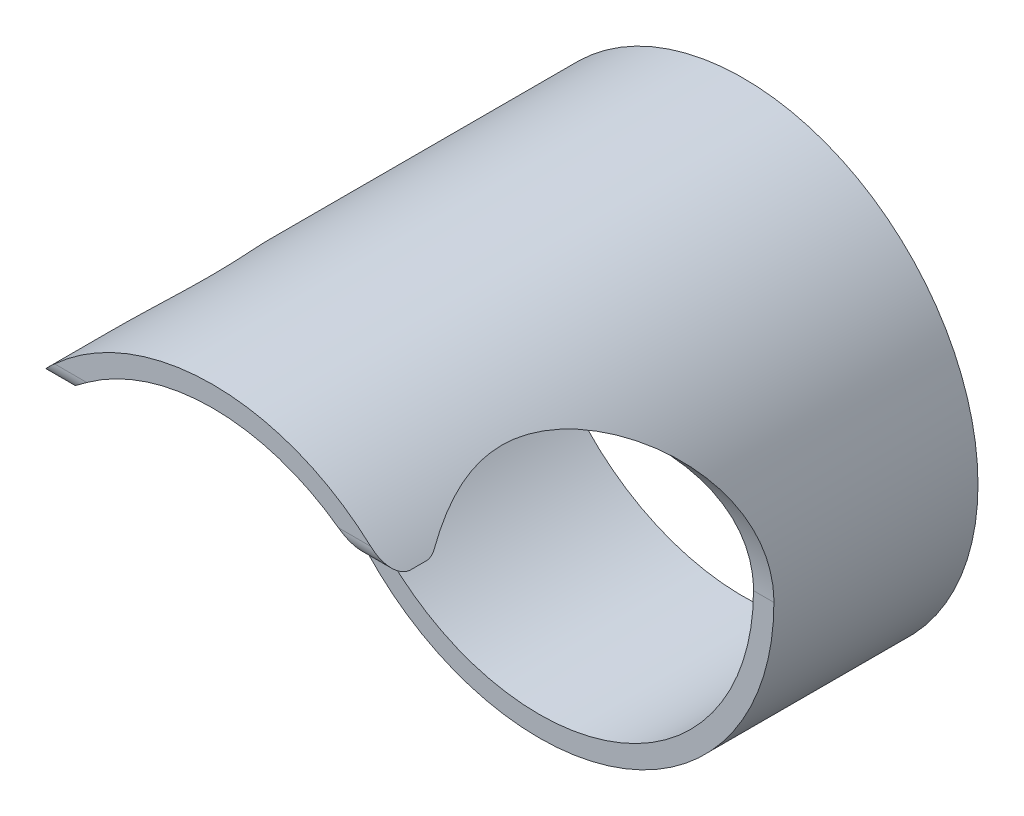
ISO-10303-21;
HEADER;
FILE_DESCRIPTION(('STEP AP214'),'2;1');
FILE_NAME('part.step','',(''),(''),'','','');
FILE_SCHEMA(('AUTOMOTIVE_DESIGN { 1 0 10303 214 1 1 1 1 }'));
ENDSEC;
DATA;
#1=APPLICATION_CONTEXT('core data for automotive mechanical design processes');
#2=APPLICATION_PROTOCOL_DEFINITION('international standard','automotive_design',2000,#1);
#3=PRODUCT_CONTEXT('',#1,'mechanical');
#4=PRODUCT('Part','Part','',(#3));
#5=PRODUCT_RELATED_PRODUCT_CATEGORY('part','',(#4));
#6=PRODUCT_DEFINITION_FORMATION('','',#4);
#7=PRODUCT_DEFINITION_CONTEXT('part definition',#1,'design');
#8=PRODUCT_DEFINITION('design','',#6,#7);
#9=PRODUCT_DEFINITION_SHAPE('','',#8);
#10=(LENGTH_UNIT() NAMED_UNIT(*) SI_UNIT(.MILLI.,.METRE.));
#11=(NAMED_UNIT(*) PLANE_ANGLE_UNIT() SI_UNIT($,.RADIAN.));
#12=(NAMED_UNIT(*) SI_UNIT($,.STERADIAN.) SOLID_ANGLE_UNIT());
#13=UNCERTAINTY_MEASURE_WITH_UNIT(LENGTH_MEASURE(1.E-05),#10,'distance_accuracy_value','');
#14=(GEOMETRIC_REPRESENTATION_CONTEXT(3) GLOBAL_UNCERTAINTY_ASSIGNED_CONTEXT((#13)) GLOBAL_UNIT_ASSIGNED_CONTEXT((#10,
#11,#12)) REPRESENTATION_CONTEXT('',''));
#15=CARTESIAN_POINT('',(0.,0.,0.));
#16=DIRECTION('',(0.,0.,1.));
#17=DIRECTION('',(1.,0.,0.));
#18=AXIS2_PLACEMENT_3D('',#15,#16,#17);
#19=CARTESIAN_POINT('',(0.,0.,130.));
#20=DIRECTION('',(0.,0.,-1.));
#21=DIRECTION('',(-1.,0.,0.));
#22=AXIS2_PLACEMENT_3D('',#19,#20,#21);
#23=CYLINDRICAL_SURFACE('',#22,57.5);
#24=CARTESIAN_POINT('',(0.,0.,0.));
#25=DIRECTION('',(0.,0.,1.));
#26=DIRECTION('',(1.,0.,0.));
#27=AXIS2_PLACEMENT_3D('',#24,#25,#26);
#28=CIRCLE('',#27,57.5);
#29=CARTESIAN_POINT('',(57.5,0.,0.));
#30=VERTEX_POINT('',#29);
#31=EDGE_CURVE('E271',#30,#30,#28,.T.);
#32=ORIENTED_EDGE('',*,*,#31,.T.);
#33=EDGE_LOOP('',(#32));
#34=FACE_BOUND('',#33,.T.);
#35=DIRECTION('',(0.,0.,-1.));
#36=VECTOR('',#35,1.);
#37=CARTESIAN_POINT('',(43.5889894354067,37.5,130.));
#38=LINE('',#37,#36);
#39=CARTESIAN_POINT('',(43.5889894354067,37.5,125.));
#40=VERTEX_POINT('',#39);
#41=CARTESIAN_POINT('',(43.5889894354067,37.5,121.339134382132));
#42=VERTEX_POINT('',#41);
#43=EDGE_CURVE('E129',#40,#42,#38,.T.);
#44=ORIENTED_EDGE('',*,*,#43,.T.);
#45=CARTESIAN_POINT('',(43.5889894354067,37.5,121.339134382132));
#46=CARTESIAN_POINT('',(43.5890098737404,37.4999712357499,121.22110299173));
#47=CARTESIAN_POINT('',(43.5853948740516,37.5041780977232,121.10308494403));
#48=CARTESIAN_POINT('',(43.5710463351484,37.5208494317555,120.868130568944));
#49=CARTESIAN_POINT('',(43.5603166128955,37.5333094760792,120.75119369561));
#50=CARTESIAN_POINT('',(43.532297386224,37.5658022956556,120.522645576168));
#51=CARTESIAN_POINT('',(43.5152043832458,37.5856081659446,120.410977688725));
#52=CARTESIAN_POINT('',(43.474697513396,37.6324546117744,120.190345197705));
#53=CARTESIAN_POINT('',(43.4512835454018,37.6594953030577,120.081380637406));
#54=CARTESIAN_POINT('',(43.396895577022,37.7221588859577,119.860564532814));
#55=CARTESIAN_POINT('',(43.3655583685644,37.7581925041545,119.748919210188));
#56=CARTESIAN_POINT('',(43.2965754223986,37.8372740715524,119.530121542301));
#57=CARTESIAN_POINT('',(43.2589275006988,37.8803244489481,119.422970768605));
#58=CARTESIAN_POINT('',(43.17652193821,37.9742277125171,119.21044985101));
#59=CARTESIAN_POINT('',(43.1315774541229,38.0252839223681,119.105242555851));
#60=CARTESIAN_POINT('',(43.0360600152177,38.1333548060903,118.900732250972));
#61=CARTESIAN_POINT('',(42.9854920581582,38.1903641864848,118.801424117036));
#62=CARTESIAN_POINT('',(42.9323595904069,38.25,118.705220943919));
#63=B_SPLINE_CURVE_WITH_KNOTS('',3,(#45,#46,#47,#48,#49,#50,#51,#52,#53,#54,#55,#56,#57,#58,#59,
#60,#61,#62),.UNSPECIFIED.,.F.,.F.,(4,2,2,2,2,2,2,2,4),(0.,0.353943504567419,0.707697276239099,
1.05132800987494,1.39496424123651,1.75877988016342,2.12272168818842,2.49814635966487,
2.87324000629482),.UNSPECIFIED.);
#64=CARTESIAN_POINT('',(42.9323595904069,38.25,118.705220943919));
#65=VERTEX_POINT('',#64);
#66=EDGE_CURVE('E114',#42,#65,#63,.T.);
#67=ORIENTED_EDGE('',*,*,#66,.T.);
#68=CARTESIAN_POINT('',(43.5889894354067,37.5,119.874685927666));
#69=CARTESIAN_POINT('',(43.3441791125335,37.7845707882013,119.445662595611));
#70=CARTESIAN_POINT('',(43.1005511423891,38.0621109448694,119.011288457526));
#71=CARTESIAN_POINT('',(42.6168254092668,38.6029486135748,118.131777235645));
#72=CARTESIAN_POINT('',(42.3767279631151,38.8662448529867,117.686639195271));
#73=CARTESIAN_POINT('',(41.9008952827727,39.378769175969,116.784899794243));
#74=CARTESIAN_POINT('',(41.6651675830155,39.6279742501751,116.328281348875));
#75=CARTESIAN_POINT('',(41.199814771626,40.1115686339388,115.404263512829));
#76=CARTESIAN_POINT('',(40.9701895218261,40.3459582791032,114.936864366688));
#77=CARTESIAN_POINT('',(40.2859477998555,41.0330812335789,113.504564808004));
#78=CARTESIAN_POINT('',(39.8429367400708,41.4623250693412,112.522608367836));
#79=CARTESIAN_POINT('',(39.0015243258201,42.2547637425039,110.514477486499));
#80=CARTESIAN_POINT('',(38.6030953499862,42.6179995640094,109.488330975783));
#81=CARTESIAN_POINT('',(37.9512991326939,43.1983009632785,107.634106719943));
#82=CARTESIAN_POINT('',(37.6856584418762,43.4297629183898,106.814855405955));
#83=CARTESIAN_POINT('',(37.1979345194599,43.8482268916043,105.152222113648));
#84=CARTESIAN_POINT('',(36.975849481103,44.035230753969,104.30884113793));
#85=CARTESIAN_POINT('',(36.5843600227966,44.3610111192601,102.605781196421));
#86=CARTESIAN_POINT('',(36.4146679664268,44.5000514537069,101.746219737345));
#87=CARTESIAN_POINT('',(36.1334755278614,44.7286820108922,100.011038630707));
#88=CARTESIAN_POINT('',(36.0219723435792,44.8182746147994,99.1354197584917));
#89=CARTESIAN_POINT('',(35.8617602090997,44.9465793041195,97.366200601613));
#90=CARTESIAN_POINT('',(35.8136589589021,44.9847990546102,96.4725084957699));
#91=CARTESIAN_POINT('',(35.7847769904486,45.0077782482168,94.6833593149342));
#92=CARTESIAN_POINT('',(35.8039944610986,44.9925391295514,93.7879022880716));
#93=CARTESIAN_POINT('',(35.908805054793,44.9089312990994,92.0019175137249));
#94=CARTESIAN_POINT('',(35.994510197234,44.8404729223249,91.1114006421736));
#95=CARTESIAN_POINT('',(36.2280424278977,44.6520010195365,89.3441188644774));
#96=CARTESIAN_POINT('',(36.3758784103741,44.5319801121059,88.4673559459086));
#97=CARTESIAN_POINT('',(36.7546731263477,44.220054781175,86.5962594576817));
#98=CARTESIAN_POINT('',(36.9950757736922,44.0197879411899,85.6052420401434));
#99=CARTESIAN_POINT('',(37.5377005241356,43.5579789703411,83.6550679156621));
#100=CARTESIAN_POINT('',(37.8399356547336,43.2964239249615,82.6959179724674));
#101=CARTESIAN_POINT('',(38.494273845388,42.7157174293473,80.8104687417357));
#102=CARTESIAN_POINT('',(38.8464826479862,42.3964434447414,79.8842444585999));
#103=CARTESIAN_POINT('',(39.588679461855,41.7042423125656,78.067750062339));
#104=CARTESIAN_POINT('',(39.9786703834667,41.3313110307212,77.1774827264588));
#105=CARTESIAN_POINT('',(40.6720818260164,40.6472329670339,75.679660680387));
#106=CARTESIAN_POINT('',(40.9688242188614,40.3484060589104,75.063305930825));
#107=CARTESIAN_POINT('',(41.5732698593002,39.7253268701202,73.8490159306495));
#108=CARTESIAN_POINT('',(41.8809740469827,39.4010724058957,73.251082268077));
#109=CARTESIAN_POINT('',(42.5044506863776,38.7276680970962,72.0734221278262));
#110=CARTESIAN_POINT('',(42.8202257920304,38.3785099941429,71.4937017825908));
#111=CARTESIAN_POINT('',(43.4570574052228,37.6558927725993,70.3526940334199));
#112=CARTESIAN_POINT('',(43.77811378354,37.2824342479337,69.7914061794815));
#113=CARTESIAN_POINT('',(44.7462079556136,36.1253097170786,68.1340429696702));
#114=CARTESIAN_POINT('',(45.3976385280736,35.3054617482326,67.065457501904));
#115=CARTESIAN_POINT('',(46.6943678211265,33.5716924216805,65.004087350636));
#116=CARTESIAN_POINT('',(47.339667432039,32.6577849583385,64.0112915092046));
#117=CARTESIAN_POINT('',(48.6195646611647,30.7206511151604,62.0889873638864));
#118=CARTESIAN_POINT('',(49.2537982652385,29.6958410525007,61.1608287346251));
#119=CARTESIAN_POINT('',(50.4848705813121,27.5509748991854,59.3927742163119));
#120=CARTESIAN_POINT('',(51.0817037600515,26.4309047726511,58.5528913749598));
#121=CARTESIAN_POINT('',(51.9365386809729,24.6833134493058,57.367188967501));
#122=CARTESIAN_POINT('',(52.2145080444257,24.0901182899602,56.9846299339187));
#123=CARTESIAN_POINT('',(52.7553809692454,22.881387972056,56.2450789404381));
#124=CARTESIAN_POINT('',(53.0182867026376,22.2658560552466,55.888083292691));
#125=CARTESIAN_POINT('',(53.5270622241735,21.0133378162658,55.2011355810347));
#126=CARTESIAN_POINT('',(53.7729379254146,20.3763590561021,54.8711741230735));
#127=CARTESIAN_POINT('',(54.2458414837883,19.0817617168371,54.2396627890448));
#128=CARTESIAN_POINT('',(54.4728713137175,18.4241453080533,53.9381099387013));
#129=CARTESIAN_POINT('',(54.9938503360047,16.8195342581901,53.2490349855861));
#130=CARTESIAN_POINT('',(55.2777773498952,15.8629699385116,52.8760032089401));
#131=CARTESIAN_POINT('',(55.7998834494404,13.9154328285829,52.1931618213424));
#132=CARTESIAN_POINT('',(56.0380656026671,12.9244623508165,51.8833479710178));
#133=CARTESIAN_POINT('',(56.463805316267,10.9151903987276,51.3314519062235));
#134=CARTESIAN_POINT('',(56.6514549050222,9.89694237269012,51.0892465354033));
#135=CARTESIAN_POINT('',(56.9727990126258,7.83802090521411,50.6754369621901));
#136=CARTESIAN_POINT('',(57.1065153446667,6.79735670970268,50.5038042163));
#137=CARTESIAN_POINT('',(57.2595808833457,5.27435902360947,50.3075960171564));
#138=CARTESIAN_POINT('',(57.3014905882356,4.79779807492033,50.2539204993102));
#139=CARTESIAN_POINT('',(57.373471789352,3.84239890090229,50.161778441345));
#140=CARTESIAN_POINT('',(57.4035461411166,3.36356125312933,50.1233082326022));
#141=CARTESIAN_POINT('',(57.4517141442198,2.4043833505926,50.061710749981));
#142=CARTESIAN_POINT('',(57.4698097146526,1.92404334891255,50.0385810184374));
#143=CARTESIAN_POINT('',(57.4939586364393,0.962471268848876,50.0077195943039));
#144=CARTESIAN_POINT('',(57.5000095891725,0.481239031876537,49.9999909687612));
#145=CARTESIAN_POINT('',(57.5,0.,50.));
#146=B_SPLINE_CURVE_WITH_KNOTS('',3,(#68,#69,#70,#71,#72,#73,#74,#75,#76,#77,#78,#79,#80,#81,
#82,#83,#84,#85,#86,#87,#88,#89,#90,#91,#92,#93,#94,#95,#96,#97,#98,#99,#100,#101,#102,#103,
#104,#105,#106,#107,#108,#109,#110,#111,#112,#113,#114,#115,#116,#117,#118,#119,#120,#121,#122,
#123,#124,#125,#126,#127,#128,#129,#130,#131,#132,#133,#134,#135,#136,#137,#138,#139,#140,#141,
#142,#143,#144,#145),.UNSPECIFIED.,.F.,.F.,(4,2,2,2,2,2,2,2,2,2,2,2,2,2,2,2,2,2,2,2,2,2,2,2,2,2,
2,2,2,2,2,2,2,2,2,2,2,2,4),(0.,1.71013643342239,3.42042540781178,5.13343091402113,
6.84639760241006,10.3219015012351,13.7952400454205,16.4684560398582,19.1415611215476,
21.7997186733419,24.4577482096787,27.1410737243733,29.824327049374,32.5121110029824,
35.200279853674,38.3132603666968,41.4268974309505,44.5472239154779,47.6677909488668,
49.906551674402,52.1455048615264,54.3852039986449,56.6248484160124,61.1079016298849,
65.590293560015,70.1482787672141,74.7069367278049,76.9820376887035,79.2568097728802,
81.5307880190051,83.8045279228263,86.9969114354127,90.1890807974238,93.3753967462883,
96.5604227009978,98.0043197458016,99.4478682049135,100.891185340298,102.334789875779),.UNSPECIFIED.);
#147=CARTESIAN_POINT('',(57.5,0.,50.));
#148=VERTEX_POINT('',#147);
#149=EDGE_CURVE('E108',#65,#148,#146,.T.);
#150=ORIENTED_EDGE('',*,*,#149,.T.);
#151=CARTESIAN_POINT('',(0.,0.,50.));
#152=DIRECTION('',(0.,0.,-1.));
#153=DIRECTION('',(-1.,0.,0.));
#154=AXIS2_PLACEMENT_3D('',#151,#152,#153);
#155=CIRCLE('',#154,57.5);
#156=CARTESIAN_POINT('',(-57.5,0.,50.));
#157=VERTEX_POINT('',#156);
#158=EDGE_CURVE('E112',#148,#157,#155,.T.);
#159=ORIENTED_EDGE('',*,*,#158,.T.);
#160=CARTESIAN_POINT('',(-57.5,0.,50.));
#161=CARTESIAN_POINT('',(-57.5000161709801,0.54658304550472,49.999984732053));
#162=CARTESIAN_POINT('',(-57.4922067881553,1.09315626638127,50.0099581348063));
#163=CARTESIAN_POINT('',(-57.4610574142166,2.18511298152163,50.0497675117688));
#164=CARTESIAN_POINT('',(-57.4377180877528,2.73049652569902,50.0796026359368));
#165=CARTESIAN_POINT('',(-57.3756496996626,3.81859328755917,50.1589946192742));
#166=CARTESIAN_POINT('',(-57.336930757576,4.36130802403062,50.2085385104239));
#167=CARTESIAN_POINT('',(-57.244351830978,5.44326643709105,50.3271092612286));
#168=CARTESIAN_POINT('',(-57.1904917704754,5.98251009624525,50.3961362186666));
#169=CARTESIAN_POINT('',(-57.0075421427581,7.58551326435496,50.6308705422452));
#170=CARTESIAN_POINT('',(-56.8566008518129,8.64285579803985,50.8248453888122));
#171=CARTESIAN_POINT('',(-56.4995445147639,10.7319811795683,51.2853617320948));
#172=CARTESIAN_POINT('',(-56.2934228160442,11.7637609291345,51.5519119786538));
#173=CARTESIAN_POINT('',(-55.8308809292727,13.7928530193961,52.1528999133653));
#174=CARTESIAN_POINT('',(-55.5745848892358,14.7902434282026,52.4871701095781));
#175=CARTESIAN_POINT('',(-55.0163044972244,16.747910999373,53.2196224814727));
#176=CARTESIAN_POINT('',(-54.7143214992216,17.7081892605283,53.6178027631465));
#177=CARTESIAN_POINT('',(-54.0694085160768,19.589264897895,54.4743226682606));
#178=CARTESIAN_POINT('',(-53.726411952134,20.5099946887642,54.9327602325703));
#179=CARTESIAN_POINT('',(-53.0053438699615,22.3074351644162,55.9049526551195));
#180=CARTESIAN_POINT('',(-52.6272680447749,23.1841404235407,56.4187143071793));
#181=CARTESIAN_POINT('',(-51.7094277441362,25.1785867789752,57.678968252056));
#182=CARTESIAN_POINT('',(-51.1580326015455,26.2782886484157,58.4456399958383));
#183=CARTESIAN_POINT('',(-50.0155678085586,28.3925681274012,60.0624204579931));
#184=CARTESIAN_POINT('',(-49.4244860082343,29.4071194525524,60.9125547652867));
#185=CARTESIAN_POINT('',(-48.2145170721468,31.3516254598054,62.6918510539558));
#186=CARTESIAN_POINT('',(-47.5955668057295,32.2813719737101,63.6211972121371));
#187=CARTESIAN_POINT('',(-46.3450648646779,34.0523126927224,65.5524739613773));
#188=CARTESIAN_POINT('',(-45.7135145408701,34.8935163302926,66.554396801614));
#189=CARTESIAN_POINT('',(-44.4434332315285,36.4978343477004,68.6434554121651));
#190=CARTESIAN_POINT('',(-43.8049320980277,37.2596551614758,69.731607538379));
#191=CARTESIAN_POINT('',(-42.8622951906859,38.3314592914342,71.4173245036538));
#192=CARTESIAN_POINT('',(-42.550515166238,38.6769946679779,71.9883156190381));
#193=CARTESIAN_POINT('',(-41.9345870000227,39.3439481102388,73.1481971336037));
#194=CARTESIAN_POINT('',(-41.6304380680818,39.6653686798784,73.7370856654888));
#195=CARTESIAN_POINT('',(-41.0334107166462,40.2826651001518,74.9311844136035));
#196=CARTESIAN_POINT('',(-40.7405032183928,40.5786097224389,75.5363445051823));
#197=CARTESIAN_POINT('',(-40.1681668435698,41.1452369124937,76.7646781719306));
#198=CARTESIAN_POINT('',(-39.8887386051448,41.4159182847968,77.3878525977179));
#199=CARTESIAN_POINT('',(-39.3470504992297,41.9308856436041,78.6517252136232));
#200=CARTESIAN_POINT('',(-39.0847779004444,42.1751912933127,79.2924098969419));
#201=CARTESIAN_POINT('',(-38.5810279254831,42.6364977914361,80.5915247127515));
#202=CARTESIAN_POINT('',(-38.3395493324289,42.8535002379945,81.249953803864));
#203=CARTESIAN_POINT('',(-37.8403049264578,43.2953989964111,82.7042621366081));
#204=CARTESIAN_POINT('',(-37.5874284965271,43.5146881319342,83.5035532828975));
#205=CARTESIAN_POINT('',(-37.1237506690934,43.9109357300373,85.1244956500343));
#206=CARTESIAN_POINT('',(-36.9129421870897,44.0879013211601,85.9461430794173));
#207=CARTESIAN_POINT('',(-36.5410614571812,44.3966134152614,87.6072567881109));
#208=CARTESIAN_POINT('',(-36.3798863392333,44.5284535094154,88.4466823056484));
#209=CARTESIAN_POINT('',(-36.1132401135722,44.7449838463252,90.1404572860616));
#210=CARTESIAN_POINT('',(-36.0077684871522,44.8296745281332,90.9948066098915));
#211=CARTESIAN_POINT('',(-35.8568247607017,44.950502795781,92.7187160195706));
#212=CARTESIAN_POINT('',(-35.8118038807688,44.9862752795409,93.5883419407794));
#213=CARTESIAN_POINT('',(-35.7854853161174,45.0072143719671,95.3291515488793));
#214=CARTESIAN_POINT('',(-35.8041856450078,44.992382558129,96.2003351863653));
#215=CARTESIAN_POINT('',(-35.9044067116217,44.9124436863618,97.9375651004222));
#216=CARTESIAN_POINT('',(-35.9859888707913,44.8472874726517,98.803605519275));
#217=CARTESIAN_POINT('',(-36.2080857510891,44.6681614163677,100.522937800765));
#218=CARTESIAN_POINT('',(-36.3486077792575,44.5541855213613,101.37622806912));
#219=CARTESIAN_POINT('',(-36.71304648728,44.2545766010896,103.219258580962));
#220=CARTESIAN_POINT('',(-36.947518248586,44.059647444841,104.205394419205));
#221=CARTESIAN_POINT('',(-37.4783080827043,43.6090264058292,106.146598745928));
#222=CARTESIAN_POINT('',(-37.7746448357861,43.3533161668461,107.101657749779));
#223=CARTESIAN_POINT('',(-38.4176232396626,42.7845865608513,108.980169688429));
#224=CARTESIAN_POINT('',(-38.7644055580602,42.4714062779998,109.903525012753));
#225=CARTESIAN_POINT('',(-39.4960622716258,41.7918667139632,111.714520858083));
#226=CARTESIAN_POINT('',(-39.8809296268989,41.4255172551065,112.602167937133));
#227=CARTESIAN_POINT('',(-40.5391703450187,40.7793820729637,114.037507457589));
#228=CARTESIAN_POINT('',(-40.8044764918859,40.514116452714,114.595547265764));
#229=CARTESIAN_POINT('',(-41.3444912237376,39.9628809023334,115.696547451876));
#230=CARTESIAN_POINT('',(-41.6191984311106,39.6769139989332,116.239510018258));
#231=CARTESIAN_POINT('',(-42.1736269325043,39.0870525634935,117.306300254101));
#232=CARTESIAN_POINT('',(-42.453292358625,38.7833153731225,117.830244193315));
#233=CARTESIAN_POINT('',(-43.0177678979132,38.156257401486,118.863461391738));
#234=CARTESIAN_POINT('',(-43.3025781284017,37.8329361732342,119.372734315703));
#235=CARTESIAN_POINT('',(-43.5889894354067,37.5,119.874685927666));
#236=B_SPLINE_CURVE_WITH_KNOTS('',3,(#160,#161,#162,#163,#164,#165,#166,#167,#168,#169,#170,
#171,#172,#173,#174,#175,#176,#177,#178,#179,#180,#181,#182,#183,#184,#185,#186,#187,#188,#189,
#190,#191,#192,#193,#194,#195,#196,#197,#198,#199,#200,#201,#202,#203,#204,#205,#206,#207,#208,
#209,#210,#211,#212,#213,#214,#215,#216,#217,#218,#219,#220,#221,#222,#223,#224,#225,#226,#227,
#228,#229,#230,#231,#232,#233,#234,#235),.UNSPECIFIED.,.F.,.F.,(4,2,2,2,2,2,2,2,2,2,2,2,2,2,2,2,
2,2,2,2,2,2,2,2,2,2,2,2,2,2,2,2,2,2,2,2,2,4),(0.,1.63958485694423,3.27909954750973,
4.91753724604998,6.55598316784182,9.80792474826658,13.0602585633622,16.3046444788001,
19.5489342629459,22.7985640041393,26.0485932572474,30.3911059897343,34.7349542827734,
39.0891934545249,43.4429682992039,47.8592096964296,50.0685923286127,52.2777452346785,
54.4807342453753,56.6838274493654,58.8852667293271,61.0865770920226,63.6840353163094,
66.2810557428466,68.8726567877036,71.4642336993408,74.0750492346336,76.6857833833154,
79.2990708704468,81.9126824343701,85.0045687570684,88.0973900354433,91.1990071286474,
94.3000519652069,96.3168344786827,98.3333227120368,100.334072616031,102.334868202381),.UNSPECIFIED.);
#237=CARTESIAN_POINT('',(-42.9323595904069,38.25,118.705220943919));
#238=VERTEX_POINT('',#237);
#239=EDGE_CURVE('E119',#157,#238,#236,.T.);
#240=ORIENTED_EDGE('',*,*,#239,.T.);
#241=CARTESIAN_POINT('',(-42.9323595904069,38.25,118.705220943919));
#242=CARTESIAN_POINT('',(-42.9827103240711,38.1934863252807,118.796391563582));
#243=CARTESIAN_POINT('',(-43.0307578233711,38.1393316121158,118.890344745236));
#244=CARTESIAN_POINT('',(-43.1218245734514,38.0363373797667,119.083544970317));
#245=CARTESIAN_POINT('',(-43.1648404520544,37.9875014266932,119.182795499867));
#246=CARTESIAN_POINT('',(-43.2441880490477,37.8971465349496,119.383251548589));
#247=CARTESIAN_POINT('',(-43.2806772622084,37.8554566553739,119.484317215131));
#248=CARTESIAN_POINT('',(-43.3480425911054,37.7782983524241,119.690602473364));
#249=CARTESIAN_POINT('',(-43.3789193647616,37.7428291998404,119.795821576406));
#250=CARTESIAN_POINT('',(-43.4360425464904,37.6770779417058,120.015070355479));
#251=CARTESIAN_POINT('',(-43.4619904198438,37.6471323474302,120.129279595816));
#252=CARTESIAN_POINT('',(-43.5069181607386,37.5952024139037,120.36084632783));
#253=CARTESIAN_POINT('',(-43.5258978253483,37.5732183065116,120.478203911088));
#254=CARTESIAN_POINT('',(-43.5570535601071,37.5370977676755,120.718793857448));
#255=CARTESIAN_POINT('',(-43.5690014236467,37.5232246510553,120.842095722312));
#256=CARTESIAN_POINT('',(-43.5849844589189,37.5046551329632,121.089970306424));
#257=CARTESIAN_POINT('',(-43.5890147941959,37.4999643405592,121.214543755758));
#258=CARTESIAN_POINT('',(-43.5889894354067,37.5,121.339134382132));
#259=B_SPLINE_CURVE_WITH_KNOTS('',3,(#241,#242,#243,#244,#245,#246,#247,#248,#249,#250,#251,
#252,#253,#254,#255,#256,#257,#258),.UNSPECIFIED.,.F.,.F.,(4,2,2,2,2,2,2,2,4),(0.,
0.355463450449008,0.711163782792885,1.05656319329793,1.40192208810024,1.76409117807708,
2.12627081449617,2.49963515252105,2.87322749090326),.UNSPECIFIED.);
#260=CARTESIAN_POINT('',(-43.5889894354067,37.5,121.339134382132));
#261=VERTEX_POINT('',#260);
#262=EDGE_CURVE('E191',#238,#261,#259,.T.);
#263=ORIENTED_EDGE('',*,*,#262,.T.);
#264=DIRECTION('',(0.,0.,-1.));
#265=VECTOR('',#264,1.);
#266=CARTESIAN_POINT('',(-43.5889894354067,37.5,130.));
#267=LINE('',#266,#265);
#268=CARTESIAN_POINT('',(-43.5889894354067,37.5,125.));
#269=VERTEX_POINT('',#268);
#270=EDGE_CURVE('E135',#261,#269,#267,.F.);
#271=ORIENTED_EDGE('',*,*,#270,.T.);
#272=CARTESIAN_POINT('',(-43.5889894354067,37.5,125.));
#273=CARTESIAN_POINT('',(-43.5890081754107,37.4999735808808,125.11575234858));
#274=CARTESIAN_POINT('',(-43.5855322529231,37.5040184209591,125.231491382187));
#275=CARTESIAN_POINT('',(-43.5717316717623,37.5200533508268,125.461946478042));
#276=CARTESIAN_POINT('',(-43.5614106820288,37.5320391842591,125.576663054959));
#277=CARTESIAN_POINT('',(-43.5341496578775,37.5636555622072,125.803459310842));
#278=CARTESIAN_POINT('',(-43.5172533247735,37.5832356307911,125.915551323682));
#279=CARTESIAN_POINT('',(-43.4770901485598,37.6296901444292,126.137051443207));
#280=CARTESIAN_POINT('',(-43.4538227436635,37.6565652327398,126.246459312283));
#281=CARTESIAN_POINT('',(-43.401284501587,37.7171062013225,126.461639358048));
#282=CARTESIAN_POINT('',(-43.3720263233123,37.7507577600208,126.56741866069));
#283=CARTESIAN_POINT('',(-43.3078465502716,37.8243680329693,126.774997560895));
#284=CARTESIAN_POINT('',(-43.2729228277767,37.8643291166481,126.876795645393));
#285=CARTESIAN_POINT('',(-43.1601276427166,37.9929777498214,127.175715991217));
#286=CARTESIAN_POINT('',(-43.0742672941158,38.0903899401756,127.366223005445));
#287=CARTESIAN_POINT('',(-42.9171602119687,38.267168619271,127.665001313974));
#288=CARTESIAN_POINT('',(-42.8509236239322,38.3413510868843,127.779152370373));
#289=CARTESIAN_POINT('',(-42.7115865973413,38.4965096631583,127.998345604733));
#290=CARTESIAN_POINT('',(-42.6384841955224,38.5774877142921,128.103385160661));
#291=CARTESIAN_POINT('',(-42.4100772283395,38.8289388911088,128.404669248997));
#292=CARTESIAN_POINT('',(-42.2456955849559,39.0079033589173,128.587037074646));
#293=CARTESIAN_POINT('',(-41.839606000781,39.4437964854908,128.971199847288));
#294=CARTESIAN_POINT('',(-41.5905943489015,39.7065640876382,129.158564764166));
#295=CARTESIAN_POINT('',(-41.2001516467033,40.1102637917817,129.394724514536));
#296=CARTESIAN_POINT('',(-41.0668990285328,40.2467048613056,129.466060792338));
#297=CARTESIAN_POINT('',(-40.79567712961,40.5215972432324,129.594443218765));
#298=CARTESIAN_POINT('',(-40.6577092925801,40.6600479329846,129.651493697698));
#299=CARTESIAN_POINT('',(-40.374345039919,40.9414606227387,129.753306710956));
#300=CARTESIAN_POINT('',(-40.2288488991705,41.0844475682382,129.797718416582));
#301=CARTESIAN_POINT('',(-39.9345249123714,41.3705916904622,129.873019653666));
#302=CARTESIAN_POINT('',(-39.7856964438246,41.5137488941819,129.903906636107));
#303=CARTESIAN_POINT('',(-39.4867618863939,41.7981791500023,129.952584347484));
#304=CARTESIAN_POINT('',(-39.33667946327,41.9394575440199,129.970490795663));
#305=CARTESIAN_POINT('',(-39.0345859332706,42.2207751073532,129.994186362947));
#306=CARTESIAN_POINT('',(-38.8825761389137,42.3608150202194,129.999983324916));
#307=CARTESIAN_POINT('',(-38.7298334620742,42.5,130.));
#308=B_SPLINE_CURVE_WITH_KNOTS('',3,(#272,#273,#274,#275,#276,#277,#278,#279,#280,#281,#282,
#283,#284,#285,#286,#287,#288,#289,#290,#291,#292,#293,#294,#295,#296,#297,#298,#299,#300,#301,
#302,#303,#304,#305,#306,#307),.UNSPECIFIED.,.F.,.F.,(4,2,2,2,2,2,2,2,2,2,2,2,2,2,2,2,2,4),(0.,
0.34711330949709,0.694040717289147,1.03870069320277,1.38339107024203,1.72736047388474,
2.07145935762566,2.76010576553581,3.21377554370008,3.66757544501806,4.57533601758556,
5.7913315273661,6.40178131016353,7.01204582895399,7.63788771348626,8.26384750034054,
8.88415593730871,9.50406249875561),.UNSPECIFIED.);
#309=CARTESIAN_POINT('',(-38.7298334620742,42.5,130.));
#310=VERTEX_POINT('',#309);
#311=EDGE_CURVE('E186',#269,#310,#308,.T.);
#312=ORIENTED_EDGE('',*,*,#311,.T.);
#313=CARTESIAN_POINT('',(0.,0.,130.));
#314=DIRECTION('',(0.,0.,1.));
#315=DIRECTION('',(1.,0.,0.));
#316=AXIS2_PLACEMENT_3D('',#313,#314,#315);
#317=CIRCLE('',#316,57.5);
#318=CARTESIAN_POINT('',(38.7298334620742,42.5,130.));
#319=VERTEX_POINT('',#318);
#320=EDGE_CURVE('E250',#319,#310,#317,.T.);
#321=ORIENTED_EDGE('',*,*,#320,.F.);
#322=CARTESIAN_POINT('',(38.7298334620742,42.5,130.));
#323=CARTESIAN_POINT('',(38.8312744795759,42.4075585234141,129.999996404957));
#324=CARTESIAN_POINT('',(38.932375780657,42.3147601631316,129.997436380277));
#325=CARTESIAN_POINT('',(39.1337789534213,42.1285668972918,129.98705735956));
#326=CARTESIAN_POINT('',(39.2340807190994,42.0351719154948,129.979237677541));
#327=CARTESIAN_POINT('',(39.5339901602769,41.7539074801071,129.947626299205));
#328=CARTESIAN_POINT('',(39.7321708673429,41.565351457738,129.915681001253));
#329=CARTESIAN_POINT('',(40.1253929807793,41.1858993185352,129.828195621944));
#330=CARTESIAN_POINT('',(40.3203747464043,40.9950005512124,129.772396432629));
#331=CARTESIAN_POINT('',(40.7029194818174,40.615205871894,129.635541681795));
#332=CARTESIAN_POINT('',(40.8904902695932,40.4263080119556,129.554513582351));
#333=CARTESIAN_POINT('',(41.3058785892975,40.0023051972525,129.339622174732));
#334=CARTESIAN_POINT('',(41.5308454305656,39.7685346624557,129.197393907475));
#335=CARTESIAN_POINT('',(41.9590521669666,39.3164639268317,128.865655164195));
#336=CARTESIAN_POINT('',(42.1623725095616,39.0981075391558,128.676329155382));
#337=CARTESIAN_POINT('',(42.5020288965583,38.7282516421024,128.290914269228));
#338=CARTESIAN_POINT('',(42.643601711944,38.5721537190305,128.103904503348));
#339=CARTESIAN_POINT('',(42.9032899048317,38.2830955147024,127.698080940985));
#340=CARTESIAN_POINT('',(43.0214188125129,38.1501218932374,127.479285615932));
#341=CARTESIAN_POINT('',(43.2108505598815,37.9353323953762,127.052033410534));
#342=CARTESIAN_POINT('',(43.2866923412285,37.8486694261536,126.84807113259));
#343=CARTESIAN_POINT('',(43.3826271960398,37.738574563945,126.5301740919));
#344=CARTESIAN_POINT('',(43.4116270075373,37.7052012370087,126.422256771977));
#345=CARTESIAN_POINT('',(43.4633592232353,37.6455570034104,126.203030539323));
#346=CARTESIAN_POINT('',(43.4860930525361,37.619284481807,126.091722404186));
#347=CARTESIAN_POINT('',(43.5330312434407,37.5649704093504,125.819660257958));
#348=CARTESIAN_POINT('',(43.55393927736,37.5407094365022,125.65753470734));
#349=CARTESIAN_POINT('',(43.5749274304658,37.5163404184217,125.412232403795));
#350=CARTESIAN_POINT('',(43.5801945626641,37.5102210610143,125.330018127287));
#351=CARTESIAN_POINT('',(43.5872266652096,37.5020491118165,125.165212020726));
#352=CARTESIAN_POINT('',(43.5889905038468,37.4999978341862,125.082620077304));
#353=CARTESIAN_POINT('',(43.5889894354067,37.5,125.));
#354=B_SPLINE_CURVE_WITH_KNOTS('',3,(#322,#323,#324,#325,#326,#327,#328,#329,#330,#331,#332,
#333,#334,#335,#336,#337,#338,#339,#340,#341,#342,#343,#344,#345,#346,#347,#348,#349,#350,#351,
#352,#353),.UNSPECIFIED.,.F.,.F.,(4,2,2,2,2,2,2,2,2,2,2,2,2,2,2,4),(0.,0.411680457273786,
0.823414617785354,1.64862791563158,2.48304225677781,3.31655148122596,4.37569954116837,
5.43076281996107,6.27285857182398,7.11446690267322,7.81393889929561,8.16342561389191,
8.51283277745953,9.0070683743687,9.25474901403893,9.50250965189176),.UNSPECIFIED.);
#355=EDGE_CURVE('E196',#319,#40,#354,.T.);
#356=ORIENTED_EDGE('',*,*,#355,.T.);
#357=EDGE_LOOP('',(#44,#67,#150,#159,#240,#263,#271,#312,#321,#356));
#358=FACE_BOUND('',#357,.T.);
#359=ADVANCED_FACE('F32',(#34,#358),#23,.T.);
#360=CARTESIAN_POINT('',(0.,0.,130.));
#361=DIRECTION('',(0.,0.,1.));
#362=DIRECTION('',(1.,0.,0.));
#363=AXIS2_PLACEMENT_3D('',#360,#361,#362);
#364=PLANE('',#363);
#365=CARTESIAN_POINT('',(0.,0.,130.));
#366=DIRECTION('',(0.,0.,1.));
#367=DIRECTION('',(1.,0.,0.));
#368=AXIS2_PLACEMENT_3D('',#365,#366,#367);
#369=CIRCLE('',#368,52.5);
#370=CARTESIAN_POINT('',(30.8220700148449,42.5,130.));
#371=VERTEX_POINT('',#370);
#372=CARTESIAN_POINT('',(-30.8220700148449,42.5,130.));
#373=VERTEX_POINT('',#372);
#374=EDGE_CURVE('E261',#371,#373,#369,.T.);
#375=ORIENTED_EDGE('',*,*,#374,.F.);
#376=DIRECTION('',(1.,0.,0.));
#377=VECTOR('',#376,1.);
#378=CARTESIAN_POINT('',(43.5889894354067,42.5,130.));
#379=LINE('',#378,#377);
#380=EDGE_CURVE('E255',#371,#319,#379,.T.);
#381=ORIENTED_EDGE('',*,*,#380,.T.);
#382=ORIENTED_EDGE('',*,*,#320,.T.);
#383=DIRECTION('',(1.,0.,0.));
#384=VECTOR('',#383,1.);
#385=CARTESIAN_POINT('',(-36.7423461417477,42.5,130.));
#386=LINE('',#385,#384);
#387=EDGE_CURVE('E229',#310,#373,#386,.T.);
#388=ORIENTED_EDGE('',*,*,#387,.T.);
#389=EDGE_LOOP('',(#375,#381,#382,#388));
#390=FACE_BOUND('',#389,.T.);
#391=ADVANCED_FACE('F258',(#390),#364,.T.);
#392=CARTESIAN_POINT('',(0.,0.,0.));
#393=DIRECTION('',(0.,0.,1.));
#394=DIRECTION('',(1.,0.,0.));
#395=AXIS2_PLACEMENT_3D('',#392,#393,#394);
#396=PLANE('',#395);
#397=ORIENTED_EDGE('',*,*,#31,.F.);
#398=EDGE_LOOP('',(#397));
#399=FACE_BOUND('',#398,.T.);
#400=CARTESIAN_POINT('',(0.,0.,0.));
#401=DIRECTION('',(0.,0.,1.));
#402=DIRECTION('',(1.,0.,0.));
#403=AXIS2_PLACEMENT_3D('',#400,#401,#402);
#404=CIRCLE('',#403,52.5);
#405=CARTESIAN_POINT('',(52.5,0.,0.));
#406=VERTEX_POINT('',#405);
#407=EDGE_CURVE('E118',#406,#406,#404,.T.);
#408=ORIENTED_EDGE('',*,*,#407,.T.);
#409=EDGE_LOOP('',(#408));
#410=FACE_BOUND('',#409,.T.);
#411=ADVANCED_FACE('F279',(#399,#410),#396,.F.);
#412=CARTESIAN_POINT('',(0.,0.,130.));
#413=DIRECTION('',(0.,0.,-1.));
#414=DIRECTION('',(-1.,0.,0.));
#415=AXIS2_PLACEMENT_3D('',#412,#413,#414);
#416=CYLINDRICAL_SURFACE('',#415,52.5);
#417=CARTESIAN_POINT('',(36.7423461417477,37.5,119.874685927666));
#418=CARTESIAN_POINT('',(36.4563841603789,37.7801959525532,119.452252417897));
#419=CARTESIAN_POINT('',(36.1709482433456,38.0534419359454,119.024844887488));
#420=CARTESIAN_POINT('',(35.6023108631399,38.5859687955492,118.15990606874));
#421=CARTESIAN_POINT('',(35.3191095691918,38.8452486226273,117.72237402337));
#422=CARTESIAN_POINT('',(34.7556523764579,39.3501971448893,116.836264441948));
#423=CARTESIAN_POINT('',(34.4754028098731,39.5958400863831,116.387668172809));
#424=CARTESIAN_POINT('',(33.9197924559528,40.0728317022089,115.480013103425));
#425=CARTESIAN_POINT('',(33.6444315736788,40.3041806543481,115.020954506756));
#426=CARTESIAN_POINT('',(32.8173816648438,40.9851824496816,113.609694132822));
#427=CARTESIAN_POINT('',(32.275679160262,41.4120545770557,112.640420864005));
#428=CARTESIAN_POINT('',(31.2348532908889,42.2026108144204,110.655040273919));
#429=CARTESIAN_POINT('',(30.7356973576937,42.5663434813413,109.638969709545));
#430=CARTESIAN_POINT('',(29.9537015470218,43.1181444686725,107.898222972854));
#431=CARTESIAN_POINT('',(29.6535789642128,43.3247171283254,107.187173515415));
#432=CARTESIAN_POINT('',(29.0895466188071,43.7054224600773,105.742170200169));
#433=CARTESIAN_POINT('',(28.8256374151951,43.879554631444,105.008215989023));
#434=CARTESIAN_POINT('',(28.3442443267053,44.1920334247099,103.522714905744));
#435=CARTESIAN_POINT('',(28.126490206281,44.330589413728,102.771300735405));
#436=CARTESIAN_POINT('',(27.7445389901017,44.5706372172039,101.249109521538));
#437=CARTESIAN_POINT('',(27.5803291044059,44.6721378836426,100.47833714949));
#438=CARTESIAN_POINT('',(27.3342631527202,44.823047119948,99.0414444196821));
#439=CARTESIAN_POINT('',(27.2436358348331,44.8780596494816,98.3774173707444));
#440=CARTESIAN_POINT('',(27.1105576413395,44.9585790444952,97.0427623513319));
#441=CARTESIAN_POINT('',(27.0681012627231,44.9840892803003,96.3721351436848));
#442=CARTESIAN_POINT('',(27.0333126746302,45.0050045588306,95.0289323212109));
#443=CARTESIAN_POINT('',(27.0409929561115,45.0004020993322,94.3563562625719));
#444=CARTESIAN_POINT('',(27.1061436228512,44.9611874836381,93.0144994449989));
#445=CARTESIAN_POINT('',(27.1636165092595,44.9265738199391,92.3452188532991));
#446=CARTESIAN_POINT('',(27.3253329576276,44.828394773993,91.018093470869));
#447=CARTESIAN_POINT('',(27.4293332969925,44.7649799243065,90.3602074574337));
#448=CARTESIAN_POINT('',(27.6798081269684,44.6105342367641,89.0559620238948));
#449=CARTESIAN_POINT('',(27.826283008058,44.5195031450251,88.4096027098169));
#450=CARTESIAN_POINT('',(28.1567604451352,44.3112282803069,87.1300668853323));
#451=CARTESIAN_POINT('',(28.3408105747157,44.1939512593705,86.4969082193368));
#452=CARTESIAN_POINT('',(28.7409177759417,43.9347971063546,85.2459367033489));
#453=CARTESIAN_POINT('',(28.9569786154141,43.7929170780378,84.6281256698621));
#454=CARTESIAN_POINT('',(29.3937233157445,43.5008186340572,83.4673684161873));
#455=CARTESIAN_POINT('',(29.6119484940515,43.3527265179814,82.9229514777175));
#456=CARTESIAN_POINT('',(30.0667652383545,43.0385411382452,81.8471283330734));
#457=CARTESIAN_POINT('',(30.3033581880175,42.8724465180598,81.3157231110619));
#458=CARTESIAN_POINT('',(30.7919149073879,42.5229140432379,80.2654029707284));
#459=CARTESIAN_POINT('',(31.0438888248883,42.3394646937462,79.7464966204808));
#460=CARTESIAN_POINT('',(31.5602851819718,41.9559527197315,78.7212563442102));
#461=CARTESIAN_POINT('',(31.8247070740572,41.755890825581,78.2149218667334));
#462=CARTESIAN_POINT('',(32.6347733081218,41.1301263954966,76.7107812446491));
#463=CARTESIAN_POINT('',(33.1956149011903,40.6799754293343,75.7312104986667));
#464=CARTESIAN_POINT('',(34.3413459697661,39.7175302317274,73.8183125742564));
#465=CARTESIAN_POINT('',(34.9262315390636,39.2052460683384,72.8849779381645));
#466=CARTESIAN_POINT('',(35.9138571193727,38.2979848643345,71.361652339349));
#467=CARTESIAN_POINT('',(36.3133598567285,37.9197061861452,70.7595321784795));
#468=CARTESIAN_POINT('',(37.1146522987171,37.1357868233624,69.5748562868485));
#469=CARTESIAN_POINT('',(37.5164421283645,36.7301446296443,68.9923016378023));
#470=CARTESIAN_POINT('',(38.3196024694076,35.8914385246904,67.8465691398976));
#471=CARTESIAN_POINT('',(38.7209727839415,35.4583650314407,67.2833981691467));
#472=CARTESIAN_POINT('',(39.5205845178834,34.564907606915,66.1768698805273));
#473=CARTESIAN_POINT('',(39.9188260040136,34.1045242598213,65.6335121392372));
#474=CARTESIAN_POINT('',(40.7090706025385,33.1572203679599,64.5680120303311));
#475=CARTESIAN_POINT('',(41.1010838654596,32.6703503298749,64.0458323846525));
#476=CARTESIAN_POINT('',(41.8772955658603,31.6692840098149,63.0223676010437));
#477=CARTESIAN_POINT('',(42.2614938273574,31.1550871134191,62.5210829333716));
#478=CARTESIAN_POINT('',(43.3987356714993,29.5717211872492,61.0502141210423));
#479=CARTESIAN_POINT('',(44.1369762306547,28.4611254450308,60.1128798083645));
#480=CARTESIAN_POINT('',(45.3690073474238,26.4370187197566,58.5685283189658));
#481=CARTESIAN_POINT('',(45.8761001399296,25.5482905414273,57.9393871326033));
#482=CARTESIAN_POINT('',(46.8514914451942,23.7121779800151,56.7385958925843));
#483=CARTESIAN_POINT('',(47.3197924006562,22.7647972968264,56.1669422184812));
#484=CARTESIAN_POINT('',(47.9871008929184,21.3020060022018,55.3574085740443));
#485=CARTESIAN_POINT('',(48.2036252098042,20.8075971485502,55.0956205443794));
#486=CARTESIAN_POINT('',(48.6241066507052,19.8050898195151,54.5886919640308));
#487=CARTESIAN_POINT('',(48.828064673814,19.2969923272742,54.3435502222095));
#488=CARTESIAN_POINT('',(49.222398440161,18.2677076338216,53.8707950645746));
#489=CARTESIAN_POINT('',(49.4127776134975,17.7465237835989,53.6431772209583));
#490=CARTESIAN_POINT('',(49.7790952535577,16.6914255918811,53.206190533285));
#491=CARTESIAN_POINT('',(49.9550299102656,16.1575079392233,52.9968265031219));
#492=CARTESIAN_POINT('',(50.4066960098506,14.7079032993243,52.4603941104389));
#493=CARTESIAN_POINT('',(50.6682630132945,13.781163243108,52.1509039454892));
#494=CARTESIAN_POINT('',(51.1431879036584,11.898175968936,51.5903484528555));
#495=CARTESIAN_POINT('',(51.3565547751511,10.9419342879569,51.3392722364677));
#496=CARTESIAN_POINT('',(51.6374372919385,9.49040857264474,51.0093396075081));
#497=CARTESIAN_POINT('',(51.7244918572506,9.0040357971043,50.9071948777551));
#498=CARTESIAN_POINT('',(51.8852326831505,8.02608401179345,50.7187420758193));
#499=CARTESIAN_POINT('',(51.9589209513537,7.53450579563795,50.6324316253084));
#500=CARTESIAN_POINT('',(52.0925464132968,6.54711837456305,50.4760172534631));
#501=CARTESIAN_POINT('',(52.1524886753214,6.05131079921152,50.4059073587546));
#502=CARTESIAN_POINT('',(52.2583513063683,5.05618641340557,50.2821477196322));
#503=CARTESIAN_POINT('',(52.304272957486,4.55686992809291,50.2284964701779));
#504=CARTESIAN_POINT('',(52.3691536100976,3.71964951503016,50.1527203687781));
#505=CARTESIAN_POINT('',(52.3920172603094,3.38245026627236,50.1260253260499));
#506=CARTESIAN_POINT('',(52.4312424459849,2.70723154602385,50.0802344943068));
#507=CARTESIAN_POINT('',(52.4476053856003,2.36921226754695,50.0611370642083));
#508=CARTESIAN_POINT('',(52.486881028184,1.35478319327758,50.0153040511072));
#509=CARTESIAN_POINT('',(52.5000232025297,0.67745238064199,49.9999779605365));
#510=CARTESIAN_POINT('',(52.5,0.,50.));
#511=B_SPLINE_CURVE_WITH_KNOTS('',3,(#417,#418,#419,#420,#421,#422,#423,#424,#425,#426,#427,
#428,#429,#430,#431,#432,#433,#434,#435,#436,#437,#438,#439,#440,#441,#442,#443,#444,#445,#446,
#447,#448,#449,#450,#451,#452,#453,#454,#455,#456,#457,#458,#459,#460,#461,#462,#463,#464,#465,
#466,#467,#468,#469,#470,#471,#472,#473,#474,#475,#476,#477,#478,#479,#480,#481,#482,#483,#484,
#485,#486,#487,#488,#489,#490,#491,#492,#493,#494,#495,#496,#497,#498,#499,#500,#501,#502,#503,
#504,#505,#506,#507,#508,#509,#510),.UNSPECIFIED.,.F.,.F.,(4,2,2,2,2,2,2,2,2,2,2,2,2,2,2,2,2,2,
2,2,2,2,2,2,2,2,2,2,2,2,2,2,2,2,2,2,2,2,2,2,2,2,2,2,2,2,4),(0.,1.74597011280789,
3.49207119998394,5.24136489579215,6.99062458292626,10.5563808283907,14.1193825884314,
16.5147544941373,18.9101633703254,21.2911341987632,23.6715358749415,25.6866133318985,
27.7014605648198,29.7168097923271,31.7322602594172,33.7372958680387,35.7423499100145,
37.7499584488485,39.7578034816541,41.5718676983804,43.3860687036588,45.2014798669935,
47.0168112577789,50.6591478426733,54.3008950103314,56.747125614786,59.1934912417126,
61.6407161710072,64.0878887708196,66.5305482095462,68.9732625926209,73.8553249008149,
77.4559651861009,81.0563785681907,82.8555964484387,84.654685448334,86.4533183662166,
88.2524241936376,91.2835645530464,94.3141394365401,95.8274123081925,97.3404576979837,
98.8529443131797,100.36529257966,101.382232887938,102.398953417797,104.430736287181),.UNSPECIFIED.);
#512=CARTESIAN_POINT('',(35.9609162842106,38.25,118.705220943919));
#513=VERTEX_POINT('',#512);
#514=CARTESIAN_POINT('',(52.5,0.,50.));
#515=VERTEX_POINT('',#514);
#516=EDGE_CURVE('E133',#513,#515,#511,.T.);
#517=ORIENTED_EDGE('',*,*,#516,.F.);
#518=CARTESIAN_POINT('',(35.9609162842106,38.25,118.705220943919));
#519=CARTESIAN_POINT('',(36.0153001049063,38.1988720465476,118.787710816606));
#520=CARTESIAN_POINT('',(36.0675722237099,38.1495083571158,118.872735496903));
#521=CARTESIAN_POINT('',(36.1674515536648,38.0548310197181,119.047765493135));
#522=CARTESIAN_POINT('',(36.2150542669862,38.0095212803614,119.137775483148));
#523=CARTESIAN_POINT('',(36.3054098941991,37.9232271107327,119.323272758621));
#524=CARTESIAN_POINT('',(36.3481206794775,37.882280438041,119.418798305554));
#525=CARTESIAN_POINT('',(36.4277098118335,37.8057535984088,119.61429695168));
#526=CARTESIAN_POINT('',(36.4645900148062,37.7701717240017,119.71426862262));
#527=CARTESIAN_POINT('',(36.532225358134,37.7047575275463,119.91883551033));
#528=CARTESIAN_POINT('',(36.5629422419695,37.6749611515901,120.023454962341));
#529=CARTESIAN_POINT('',(36.6174811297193,37.6219553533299,120.236101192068));
#530=CARTESIAN_POINT('',(36.6413041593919,37.5987449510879,120.344127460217));
#531=CARTESIAN_POINT('',(36.6815493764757,37.5594824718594,120.562274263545));
#532=CARTESIAN_POINT('',(36.6980066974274,37.5433964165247,120.672382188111));
#533=CARTESIAN_POINT('',(36.7233725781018,37.5185850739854,120.894226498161));
#534=CARTESIAN_POINT('',(36.7322871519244,37.5098539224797,121.005961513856));
#535=CARTESIAN_POINT('',(36.7390160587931,37.5032625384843,121.154805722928));
#536=CARTESIAN_POINT('',(36.740264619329,37.5020393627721,121.191652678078));
#537=CARTESIAN_POINT('',(36.7419294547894,37.5004082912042,121.265376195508));
#538=CARTESIAN_POINT('',(36.742345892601,37.5000002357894,121.302252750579));
#539=CARTESIAN_POINT('',(36.7423461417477,37.5,121.339134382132));
#540=B_SPLINE_CURVE_WITH_KNOTS('',3,(#518,#519,#520,#521,#522,#523,#524,#525,#526,#527,#528,
#529,#530,#531,#532,#533,#534,#535,#536,#537,#538,#539),.UNSPECIFIED.,.F.,.F.,(4,2,2,2,2,2,2,2,
2,2,4),(0.,0.333737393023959,0.667793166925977,1.00453826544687,1.34117596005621,
1.67984262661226,2.01845887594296,2.3554422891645,2.69215675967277,2.80280857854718,
2.91343873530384),.UNSPECIFIED.);
#541=CARTESIAN_POINT('',(36.7423461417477,37.5,121.339134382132));
#542=VERTEX_POINT('',#541);
#543=EDGE_CURVE('E224',#513,#542,#540,.T.);
#544=ORIENTED_EDGE('',*,*,#543,.T.);
#545=DIRECTION('',(0.,0.,-1.));
#546=VECTOR('',#545,1.);
#547=CARTESIAN_POINT('',(36.7423461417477,37.5,130.));
#548=LINE('',#547,#546);
#549=CARTESIAN_POINT('',(36.7423461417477,37.5,125.));
#550=VERTEX_POINT('',#549);
#551=EDGE_CURVE('E177',#550,#542,#548,.T.);
#552=ORIENTED_EDGE('',*,*,#551,.F.);
#553=CARTESIAN_POINT('',(36.7423461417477,37.5,125.));
#554=CARTESIAN_POINT('',(36.7423702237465,37.4999719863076,125.1101183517));
#555=CARTESIAN_POINT('',(36.7386344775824,37.5036365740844,125.220220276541));
#556=CARTESIAN_POINT('',(36.7238248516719,37.5181407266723,125.439379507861));
#557=CARTESIAN_POINT('',(36.7127560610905,37.5289753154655,125.548437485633));
#558=CARTESIAN_POINT('',(36.6835773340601,37.5574964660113,125.763796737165));
#559=CARTESIAN_POINT('',(36.6655238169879,37.5751281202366,125.870112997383));
#560=CARTESIAN_POINT('',(36.6226884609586,37.6168790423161,126.080086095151));
#561=CARTESIAN_POINT('',(36.5979058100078,37.6409990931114,126.1837426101));
#562=CARTESIAN_POINT('',(36.5420814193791,37.6951958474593,126.387418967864));
#563=CARTESIAN_POINT('',(36.5110574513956,37.7252556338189,126.487448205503));
#564=CARTESIAN_POINT('',(36.443148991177,37.7908602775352,126.683662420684));
#565=CARTESIAN_POINT('',(36.4062621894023,37.8264072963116,126.779845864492));
#566=CARTESIAN_POINT('',(36.2873939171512,37.9405735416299,127.062242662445));
#567=CARTESIAN_POINT('',(36.1972647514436,38.0266591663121,127.242087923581));
#568=CARTESIAN_POINT('',(35.9612246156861,38.2501722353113,127.647893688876));
#569=CARTESIAN_POINT('',(35.8071658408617,38.3946405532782,127.865164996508));
#570=CARTESIAN_POINT('',(35.4735132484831,38.7031206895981,128.26301769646));
#571=CARTESIAN_POINT('',(35.2938826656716,38.867160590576,128.443545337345));
#572=CARTESIAN_POINT('',(34.9687456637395,39.1595525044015,128.724272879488));
#573=CARTESIAN_POINT('',(34.8277270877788,39.2850705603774,128.832823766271));
#574=CARTESIAN_POINT('',(34.5376907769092,39.5402984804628,129.033174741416));
#575=CARTESIAN_POINT('',(34.3886693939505,39.6700102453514,129.124967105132));
#576=CARTESIAN_POINT('',(34.0836571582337,39.9323797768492,129.293216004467));
#577=CARTESIAN_POINT('',(33.9276430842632,40.0650464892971,129.369615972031));
#578=CARTESIAN_POINT('',(33.6103020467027,40.3316323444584,129.507851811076));
#579=CARTESIAN_POINT('',(33.4489737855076,40.4655517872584,129.569684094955));
#580=CARTESIAN_POINT('',(33.0882316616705,40.761304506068,129.691216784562));
#581=CARTESIAN_POINT('',(32.887829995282,40.9231937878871,129.747842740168));
#582=CARTESIAN_POINT('',(32.4819939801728,41.2460590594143,129.843135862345));
#583=CARTESIAN_POINT('',(32.2765573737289,41.4070345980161,129.881794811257));
#584=CARTESIAN_POINT('',(31.8644500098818,41.724975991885,129.942187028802));
#585=CARTESIAN_POINT('',(31.6578287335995,41.8819667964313,129.964130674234));
#586=CARTESIAN_POINT('',(31.2418552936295,42.1931766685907,129.993009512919));
#587=CARTESIAN_POINT('',(31.0325067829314,42.347398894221,129.99996304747));
#588=CARTESIAN_POINT('',(30.8220700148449,42.5,130.));
#589=B_SPLINE_CURVE_WITH_KNOTS('',3,(#553,#554,#555,#556,#557,#558,#559,#560,#561,#562,#563,
#564,#565,#566,#567,#568,#569,#570,#571,#572,#573,#574,#575,#576,#577,#578,#579,#580,#581,#582,
#583,#584,#585,#586,#587,#588),.UNSPECIFIED.,.F.,.F.,(4,2,2,2,2,2,2,2,2,2,2,2,2,2,2,2,2,4),(0.,
0.330204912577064,0.66018090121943,0.987545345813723,1.31494931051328,1.64143388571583,
1.96804739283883,2.62195784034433,3.52610189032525,4.43155923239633,5.08404015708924,
5.73682108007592,6.39195892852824,7.04725795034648,7.83781817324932,8.62873962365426,
9.40953420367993,10.1893728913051),.UNSPECIFIED.);
#590=EDGE_CURVE('E215',#550,#371,#589,.T.);
#591=ORIENTED_EDGE('',*,*,#590,.T.);
#592=ORIENTED_EDGE('',*,*,#374,.T.);
#593=CARTESIAN_POINT('',(-30.8220700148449,42.5,130.));
#594=CARTESIAN_POINT('',(-30.9627013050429,42.3980128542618,129.999992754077));
#595=CARTESIAN_POINT('',(-31.1028328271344,42.2953186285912,129.996879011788));
#596=CARTESIAN_POINT('',(-31.3819121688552,42.0886647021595,129.984129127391));
#597=CARTESIAN_POINT('',(-31.5208596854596,41.984704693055,129.974491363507));
#598=CARTESIAN_POINT('',(-31.7979145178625,41.7752668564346,129.948327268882));
#599=CARTESIAN_POINT('',(-31.936015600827,41.6697844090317,129.931771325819));
#600=CARTESIAN_POINT('',(-32.2104815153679,41.457990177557,129.891403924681));
#601=CARTESIAN_POINT('',(-32.3468464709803,41.3516784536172,129.867592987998));
#602=CARTESIAN_POINT('',(-32.7569405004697,41.0287086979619,129.783859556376));
#603=CARTESIAN_POINT('',(-33.0276060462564,40.8110884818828,129.711992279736));
#604=CARTESIAN_POINT('',(-33.557138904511,40.3767907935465,129.532883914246));
#605=CARTESIAN_POINT('',(-33.816029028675,40.1601123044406,129.425714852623));
#606=CARTESIAN_POINT('',(-34.1870405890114,39.8437111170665,129.237721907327));
#607=CARTESIAN_POINT('',(-34.3052990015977,39.7419195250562,129.172301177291));
#608=CARTESIAN_POINT('',(-34.5375982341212,39.5402064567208,129.031717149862));
#609=CARTESIAN_POINT('',(-34.6516389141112,39.4402850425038,128.956553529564));
#610=CARTESIAN_POINT('',(-34.8743551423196,39.2434880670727,128.796205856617));
#611=CARTESIAN_POINT('',(-34.9830478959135,39.1466031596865,128.711057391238));
#612=CARTESIAN_POINT('',(-35.1945546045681,38.9565600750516,128.530050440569));
#613=CARTESIAN_POINT('',(-35.2973696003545,38.8634012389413,128.434193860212));
#614=CARTESIAN_POINT('',(-35.5616255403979,38.6221488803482,128.164372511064));
#615=CARTESIAN_POINT('',(-35.7171011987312,38.4782656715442,127.980531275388));
#616=CARTESIAN_POINT('',(-36.0029573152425,38.21093308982,127.580995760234));
#617=CARTESIAN_POINT('',(-36.1333583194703,38.0874669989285,127.365327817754));
#618=CARTESIAN_POINT('',(-36.3371392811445,37.8929781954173,126.953314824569));
#619=CARTESIAN_POINT('',(-36.4167504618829,37.8163870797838,126.762747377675));
#620=CARTESIAN_POINT('',(-36.5180971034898,37.7184408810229,126.465467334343));
#621=CARTESIAN_POINT('',(-36.5488561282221,37.6886268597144,126.364525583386));
#622=CARTESIAN_POINT('',(-36.6039627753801,37.6351083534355,126.159340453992));
#623=CARTESIAN_POINT('',(-36.6283114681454,37.6114028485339,126.055097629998));
#624=CARTESIAN_POINT('',(-36.6798329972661,37.5611730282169,125.795345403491));
#625=CARTESIAN_POINT('',(-36.7031593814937,37.5383617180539,125.638296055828));
#626=CARTESIAN_POINT('',(-36.7266086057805,37.51541449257,125.400389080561));
#627=CARTESIAN_POINT('',(-36.7325017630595,37.5096435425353,125.320561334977));
#628=CARTESIAN_POINT('',(-36.7403722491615,37.5019341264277,125.16049930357));
#629=CARTESIAN_POINT('',(-36.742348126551,37.4999970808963,125.080264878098));
#630=CARTESIAN_POINT('',(-36.7423461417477,37.5,125.));
#631=B_SPLINE_CURVE_WITH_KNOTS('',3,(#593,#594,#595,#596,#597,#598,#599,#600,#601,#602,#603,
#604,#605,#606,#607,#608,#609,#610,#611,#612,#613,#614,#615,#616,#617,#618,#619,#620,#621,#622,
#623,#624,#625,#626,#627,#628,#629,#630),.UNSPECIFIED.,.F.,.F.,(4,2,2,2,2,2,2,2,2,2,2,2,2,2,2,2,
2,2,4),(0.,0.521143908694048,1.04241741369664,1.56594539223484,2.08943575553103,
3.15167953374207,4.21176927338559,4.71906906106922,5.22638566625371,5.73194615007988,
6.23741683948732,7.07565834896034,7.91321005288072,8.57111345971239,8.89971771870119,
9.22826707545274,9.70783790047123,9.94843614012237,10.1891235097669),.UNSPECIFIED.);
#632=CARTESIAN_POINT('',(-36.7423461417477,37.5,125.));
#633=VERTEX_POINT('',#632);
#634=EDGE_CURVE('E54',#373,#633,#631,.T.);
#635=ORIENTED_EDGE('',*,*,#634,.T.);
#636=DIRECTION('',(0.,0.,-1.));
#637=VECTOR('',#636,1.);
#638=CARTESIAN_POINT('',(-36.7423461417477,37.5,130.));
#639=LINE('',#638,#637);
#640=CARTESIAN_POINT('',(-36.7423461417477,37.5,121.339134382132));
#641=VERTEX_POINT('',#640);
#642=EDGE_CURVE('E268',#641,#633,#639,.F.);
#643=ORIENTED_EDGE('',*,*,#642,.F.);
#644=CARTESIAN_POINT('',(-36.7423461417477,37.5,121.339134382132));
#645=CARTESIAN_POINT('',(-36.74237039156,37.4999716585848,121.227869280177));
#646=CARTESIAN_POINT('',(-36.7385564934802,37.5037129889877,121.116623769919));
#647=CARTESIAN_POINT('',(-36.7234388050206,37.5185186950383,120.895207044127));
#648=CARTESIAN_POINT('',(-36.7121401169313,37.52957808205,120.785035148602));
#649=CARTESIAN_POINT('',(-36.6823349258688,37.5587101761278,120.567348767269));
#650=CARTESIAN_POINT('',(-36.663875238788,37.5767373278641,120.45982174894));
#651=CARTESIAN_POINT('',(-36.6200885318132,37.6194105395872,120.247537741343));
#652=CARTESIAN_POINT('',(-36.5947609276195,37.6440571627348,120.142780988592));
#653=CARTESIAN_POINT('',(-36.5092190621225,37.727089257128,119.834319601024));
#654=CARTESIAN_POINT('',(-36.4393369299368,37.794674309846,119.635657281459));
#655=CARTESIAN_POINT('',(-36.2776107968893,37.9499328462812,119.256095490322));
#656=CARTESIAN_POINT('',(-36.185761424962,38.0376112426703,119.075200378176));
#657=CARTESIAN_POINT('',(-36.0649955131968,38.1518920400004,118.870233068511));
#658=CARTESIAN_POINT('',(-36.0446319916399,38.1711320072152,118.836658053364));
#659=CARTESIAN_POINT('',(-36.0032604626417,38.2101562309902,118.7703379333));
#660=CARTESIAN_POINT('',(-35.982253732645,38.2299394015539,118.737591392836));
#661=CARTESIAN_POINT('',(-35.9609162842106,38.25,118.705220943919));
#662=B_SPLINE_CURVE_WITH_KNOTS('',3,(#644,#645,#646,#647,#648,#649,#650,#651,#652,#653,#654,
#655,#656,#657,#658,#659,#660,#661),.UNSPECIFIED.,.F.,.F.,(4,2,2,2,2,2,2,2,4),(0.,
0.333635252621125,0.667043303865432,0.99830742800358,1.32959974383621,1.98987222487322,
2.65030631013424,2.78148521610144,2.91241862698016),.UNSPECIFIED.);
#663=CARTESIAN_POINT('',(-35.9609162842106,38.25,118.705220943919));
#664=VERTEX_POINT('',#663);
#665=EDGE_CURVE('E48',#641,#664,#662,.T.);
#666=ORIENTED_EDGE('',*,*,#665,.T.);
#667=CARTESIAN_POINT('',(-52.5,0.,50.));
#668=CARTESIAN_POINT('',(-52.500016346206,0.532498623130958,49.9999842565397));
#669=CARTESIAN_POINT('',(-52.4918987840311,1.06498725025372,50.0094515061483));
#670=CARTESIAN_POINT('',(-52.4595178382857,2.128779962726,50.0472338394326));
#671=CARTESIAN_POINT('',(-52.4352551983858,2.66008410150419,50.075548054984));
#672=CARTESIAN_POINT('',(-52.3707288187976,3.72001889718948,50.1508796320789));
#673=CARTESIAN_POINT('',(-52.3304763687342,4.24865117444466,50.1978837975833));
#674=CARTESIAN_POINT('',(-52.2342219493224,5.30246738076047,50.3103504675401));
#675=CARTESIAN_POINT('',(-52.1782198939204,5.82765129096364,50.375813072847));
#676=CARTESIAN_POINT('',(-51.9880346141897,7.3882113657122,50.598290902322));
#677=CARTESIAN_POINT('',(-51.8311381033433,8.41722422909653,50.7820178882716));
#678=CARTESIAN_POINT('',(-51.4598541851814,10.4499671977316,51.2178168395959));
#679=CARTESIAN_POINT('',(-51.2454592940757,11.4536939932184,51.469897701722));
#680=CARTESIAN_POINT('',(-50.7641128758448,13.4269650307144,52.0376008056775));
#681=CARTESIAN_POINT('',(-50.497303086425,14.3965933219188,52.3530517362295));
#682=CARTESIAN_POINT('',(-49.9156236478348,16.2994022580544,53.0434267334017));
#683=CARTESIAN_POINT('',(-49.6007554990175,17.2325840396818,53.418348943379));
#684=CARTESIAN_POINT('',(-48.9274818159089,19.0604794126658,54.2238126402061));
#685=CARTESIAN_POINT('',(-48.5689990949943,19.9551208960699,54.6544528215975));
#686=CARTESIAN_POINT('',(-47.8141912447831,21.7015786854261,55.5663557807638));
#687=CARTESIAN_POINT('',(-47.417861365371,22.5533895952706,56.0476249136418));
#688=CARTESIAN_POINT('',(-46.4363052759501,24.5265216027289,57.2476367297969));
#689=CARTESIAN_POINT('',(-45.8363517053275,25.6278510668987,57.9873259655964));
#690=CARTESIAN_POINT('',(-44.587536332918,27.7436813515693,59.5455813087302));
#691=CARTESIAN_POINT('',(-43.9386573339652,28.7581513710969,60.3641751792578));
#692=CARTESIAN_POINT('',(-42.6034900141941,30.7015554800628,62.0744211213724));
#693=CARTESIAN_POINT('',(-41.9171230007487,31.6302976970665,62.9662290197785));
#694=CARTESIAN_POINT('',(-40.5210938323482,33.4000060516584,64.8159311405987));
#695=CARTESIAN_POINT('',(-39.811434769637,34.240983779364,65.7738166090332));
#696=CARTESIAN_POINT('',(-38.732409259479,35.4450171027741,67.2678744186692));
#697=CARTESIAN_POINT('',(-38.366580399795,35.8404412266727,67.7808553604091));
#698=CARTESIAN_POINT('',(-37.634322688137,36.6085941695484,68.8231029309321));
#699=CARTESIAN_POINT('',(-37.2678938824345,36.9813246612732,69.3523683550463));
#700=CARTESIAN_POINT('',(-36.5363932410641,37.7041973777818,70.4273887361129));
#701=CARTESIAN_POINT('',(-36.1713219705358,38.0543310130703,70.9731498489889));
#702=CARTESIAN_POINT('',(-35.4450056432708,38.7317459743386,72.081154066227));
#703=CARTESIAN_POINT('',(-35.0837605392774,39.0590275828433,72.6433969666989));
#704=CARTESIAN_POINT('',(-34.3684877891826,39.6898467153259,73.783505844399));
#705=CARTESIAN_POINT('',(-34.0144464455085,39.9934331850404,74.3613361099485));
#706=CARTESIAN_POINT('',(-33.3157857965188,40.577280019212,75.5342978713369));
#707=CARTESIAN_POINT('',(-32.97116698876,40.8575391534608,76.1294302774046));
#708=CARTESIAN_POINT('',(-32.295114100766,41.3939809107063,77.3371952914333));
#709=CARTESIAN_POINT('',(-31.9636712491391,41.650179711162,77.9498157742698));
#710=CARTESIAN_POINT('',(-31.3179188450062,42.1378883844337,79.1935312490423));
#711=CARTESIAN_POINT('',(-31.003606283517,42.369402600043,79.824622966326));
#712=CARTESIAN_POINT('',(-30.3798192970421,42.8190678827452,81.1421899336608));
#713=CARTESIAN_POINT('',(-30.0716165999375,43.0357297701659,81.8297817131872));
#714=CARTESIAN_POINT('',(-29.4865161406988,43.4387105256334,83.2268589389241));
#715=CARTESIAN_POINT('',(-29.2096147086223,43.6250329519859,83.9363418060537));
#716=CARTESIAN_POINT('',(-28.6953387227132,43.9650142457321,85.3758928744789));
#717=CARTESIAN_POINT('',(-28.4578987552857,44.1187272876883,86.1059246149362));
#718=CARTESIAN_POINT('',(-28.0305379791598,44.3914784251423,87.5863016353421));
#719=CARTESIAN_POINT('',(-27.8406175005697,44.5105162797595,88.3366470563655));
#720=CARTESIAN_POINT('',(-27.5143509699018,44.7129530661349,89.8662071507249));
#721=CARTESIAN_POINT('',(-27.3788805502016,44.7957712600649,90.6456889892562));
#722=CARTESIAN_POINT('',(-27.1733693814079,44.9207379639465,92.2165261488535));
#723=CARTESIAN_POINT('',(-27.1033208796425,44.9628912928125,93.0078800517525));
#724=CARTESIAN_POINT('',(-27.0330864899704,45.0051552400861,94.5940782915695));
#725=CARTESIAN_POINT('',(-27.0328321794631,45.0053070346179,95.3889184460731));
#726=CARTESIAN_POINT('',(-27.1020486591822,44.9636580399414,96.9744104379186));
#727=CARTESIAN_POINT('',(-27.1715182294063,44.9218579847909,97.7650623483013));
#728=CARTESIAN_POINT('',(-27.3599836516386,44.8072664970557,99.2133866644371));
#729=CARTESIAN_POINT('',(-27.4696934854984,44.7402461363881,99.8727689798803));
#730=CARTESIAN_POINT('',(-27.731361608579,44.5785285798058,101.179673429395));
#731=CARTESIAN_POINT('',(-27.8833258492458,44.4838274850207,101.827193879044));
#732=CARTESIAN_POINT('',(-28.2245264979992,44.2681240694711,103.109040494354));
#733=CARTESIAN_POINT('',(-28.4138300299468,44.1470743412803,103.74334058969));
#734=CARTESIAN_POINT('',(-28.8240566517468,43.8803323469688,104.996341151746));
#735=CARTESIAN_POINT('',(-29.0449838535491,43.7346368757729,105.615039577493));
#736=CARTESIAN_POINT('',(-29.4928714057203,43.433706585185,106.783239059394));
#737=CARTESIAN_POINT('',(-29.7176431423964,43.2803978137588,107.33408466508));
#738=CARTESIAN_POINT('',(-30.1855734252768,42.9553525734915,108.422377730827));
#739=CARTESIAN_POINT('',(-30.4287333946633,42.7836146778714,108.959824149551));
#740=CARTESIAN_POINT('',(-30.9303952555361,42.4223553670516,110.02194027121));
#741=CARTESIAN_POINT('',(-31.1889089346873,42.2328202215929,110.546599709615));
#742=CARTESIAN_POINT('',(-31.7182641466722,41.8367198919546,111.583019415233));
#743=CARTESIAN_POINT('',(-31.9891050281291,41.630155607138,112.094780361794));
#744=CARTESIAN_POINT('',(-32.8165560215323,40.9855066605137,113.611734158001));
#745=CARTESIAN_POINT('',(-33.3879894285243,40.5225404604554,114.598380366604));
#746=CARTESIAN_POINT('',(-34.5536394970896,39.5332841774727,116.524179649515));
#747=CARTESIAN_POINT('',(-35.1478422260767,39.007032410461,117.463360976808));
#748=CARTESIAN_POINT('',(-35.9126184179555,38.2960173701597,118.632655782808));
#749=CARTESIAN_POINT('',(-36.0783390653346,38.1399550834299,118.883698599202));
#750=CARTESIAN_POINT('',(-36.4100895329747,37.8233763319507,119.38194425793));
#751=CARTESIAN_POINT('',(-36.5761183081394,37.6628681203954,119.629153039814));
#752=CARTESIAN_POINT('',(-36.7423461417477,37.5,119.874685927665));
#753=B_SPLINE_CURVE_WITH_KNOTS('',3,(#667,#668,#669,#670,#671,#672,#673,#674,#675,#676,#677,
#678,#679,#680,#681,#682,#683,#684,#685,#686,#687,#688,#689,#690,#691,#692,#693,#694,#695,#696,
#697,#698,#699,#700,#701,#702,#703,#704,#705,#706,#707,#708,#709,#710,#711,#712,#713,#714,#715,
#716,#717,#718,#719,#720,#721,#722,#723,#724,#725,#726,#727,#728,#729,#730,#731,#732,#733,#734,
#735,#736,#737,#738,#739,#740,#741,#742,#743,#744,#745,#746,#747,#748,#749,#750,#751,#752),
.UNSPECIFIED.,.F.,.F.,(4,2,2,2,2,2,2,2,2,2,2,2,2,2,2,2,2,2,2,2,2,2,2,2,2,2,2,2,2,2,2,2,2,2,2,2,
2,2,2,2,2,2,4),(0.,1.59733209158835,3.19459061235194,4.79072338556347,6.38686487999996,
9.55324357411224,12.720034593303,15.8783771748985,19.0366211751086,22.2005380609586,
25.3648525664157,29.7265977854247,34.089883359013,38.4627091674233,42.8349567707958,
45.0661354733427,47.2971495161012,49.5290066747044,51.7608362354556,53.9879264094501,
56.2151339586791,58.4408331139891,60.6661400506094,63.0169013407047,65.3673867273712,
67.7139360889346,70.0605017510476,72.4434234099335,74.8260626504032,77.2063660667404,
79.5866278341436,81.5999457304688,83.6135473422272,85.6308022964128,87.6483197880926,
89.4906977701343,91.3332184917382,93.177172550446,95.0210292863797,98.7094993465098,
102.395747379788,103.412362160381,104.427201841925),.UNSPECIFIED.);
#754=CARTESIAN_POINT('',(-52.5,0.,50.));
#755=VERTEX_POINT('',#754);
#756=EDGE_CURVE('E165',#755,#664,#753,.T.);
#757=ORIENTED_EDGE('',*,*,#756,.F.);
#758=CARTESIAN_POINT('',(0.,0.,50.));
#759=DIRECTION('',(0.,0.,-1.));
#760=DIRECTION('',(-1.,0.,0.));
#761=AXIS2_PLACEMENT_3D('',#758,#759,#760);
#762=CIRCLE('',#761,52.5);
#763=EDGE_CURVE('E178',#515,#755,#762,.T.);
#764=ORIENTED_EDGE('',*,*,#763,.F.);
#765=EDGE_LOOP('',(#517,#544,#552,#591,#592,#635,#643,#666,#757,#764));
#766=FACE_BOUND('',#765,.T.);
#767=ORIENTED_EDGE('',*,*,#407,.F.);
#768=EDGE_LOOP('',(#767));
#769=FACE_BOUND('',#768,.T.);
#770=ADVANCED_FACE('F157',(#766,#769),#416,.F.);
#771=CARTESIAN_POINT('',(-57.5,0.,95.));
#772=DIRECTION('',(1.,0.,0.));
#773=DIRECTION('',(0.,0.,-1.));
#774=AXIS2_PLACEMENT_3D('',#771,#772,#773);
#775=CYLINDRICAL_SURFACE('',#774,45.);
#776=ORIENTED_EDGE('',*,*,#149,.F.);
#777=DIRECTION('',(1.,0.,0.));
#778=VECTOR('',#777,1.);
#779=CARTESIAN_POINT('',(-57.5,38.25,118.705220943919));
#780=LINE('',#779,#778);
#781=EDGE_CURVE('E240',#65,#513,#780,.F.);
#782=ORIENTED_EDGE('',*,*,#781,.T.);
#783=ORIENTED_EDGE('',*,*,#516,.T.);
#784=DIRECTION('',(1.,0.,0.));
#785=VECTOR('',#784,1.);
#786=CARTESIAN_POINT('',(-57.5,0.,50.));
#787=LINE('',#786,#785);
#788=EDGE_CURVE('E125',#515,#148,#787,.T.);
#789=ORIENTED_EDGE('',*,*,#788,.T.);
#790=EDGE_LOOP('',(#776,#782,#783,#789));
#791=FACE_BOUND('',#790,.T.);
#792=ADVANCED_FACE('F131',(#791),#775,.F.);
#793=ORIENTED_EDGE('',*,*,#756,.T.);
#794=DIRECTION('',(1.,0.,0.));
#795=VECTOR('',#794,1.);
#796=CARTESIAN_POINT('',(-57.5,38.25,118.705220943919));
#797=LINE('',#796,#795);
#798=EDGE_CURVE('E11',#664,#238,#797,.F.);
#799=ORIENTED_EDGE('',*,*,#798,.T.);
#800=ORIENTED_EDGE('',*,*,#239,.F.);
#801=EDGE_CURVE('E128',#157,#755,#787,.T.);
#802=ORIENTED_EDGE('',*,*,#801,.T.);
#803=EDGE_LOOP('',(#793,#799,#800,#802));
#804=FACE_BOUND('',#803,.T.);
#805=ADVANCED_FACE('F156',(#804),#775,.F.);
#806=CARTESIAN_POINT('',(-57.5,0.,50.));
#807=DIRECTION('',(0.,0.,-1.));
#808=DIRECTION('',(-1.,0.,0.));
#809=AXIS2_PLACEMENT_3D('',#806,#807,#808);
#810=PLANE('',#809);
#811=ORIENTED_EDGE('',*,*,#788,.F.);
#812=ORIENTED_EDGE('',*,*,#763,.T.);
#813=ORIENTED_EDGE('',*,*,#801,.F.);
#814=ORIENTED_EDGE('',*,*,#158,.F.);
#815=EDGE_LOOP('',(#811,#812,#813,#814));
#816=FACE_BOUND('',#815,.T.);
#817=ADVANCED_FACE('F124',(#816),#810,.F.);
#818=CARTESIAN_POINT('',(-57.5,37.5,130.));
#819=DIRECTION('',(0.,1.,0.));
#820=DIRECTION('',(0.,0.,1.));
#821=AXIS2_PLACEMENT_3D('',#818,#819,#820);
#822=PLANE('',#821);
#823=ORIENTED_EDGE('',*,*,#551,.T.);
#824=DIRECTION('',(1.,0.,0.));
#825=VECTOR('',#824,1.);
#826=CARTESIAN_POINT('',(-57.5,37.5,121.339134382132));
#827=LINE('',#826,#825);
#828=EDGE_CURVE('E183',#542,#42,#827,.T.);
#829=ORIENTED_EDGE('',*,*,#828,.T.);
#830=ORIENTED_EDGE('',*,*,#43,.F.);
#831=DIRECTION('',(1.,0.,0.));
#832=VECTOR('',#831,1.);
#833=CARTESIAN_POINT('',(36.7423461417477,37.5,125.));
#834=LINE('',#833,#832);
#835=EDGE_CURVE('E181',#40,#550,#834,.F.);
#836=ORIENTED_EDGE('',*,*,#835,.T.);
#837=EDGE_LOOP('',(#823,#829,#830,#836));
#838=FACE_BOUND('',#837,.T.);
#839=ADVANCED_FACE('F158',(#838),#822,.F.);
#840=ORIENTED_EDGE('',*,*,#270,.F.);
#841=DIRECTION('',(1.,0.,0.));
#842=VECTOR('',#841,1.);
#843=CARTESIAN_POINT('',(-57.5,37.5,121.339134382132));
#844=LINE('',#843,#842);
#845=EDGE_CURVE('E41',#261,#641,#844,.T.);
#846=ORIENTED_EDGE('',*,*,#845,.T.);
#847=ORIENTED_EDGE('',*,*,#642,.T.);
#848=DIRECTION('',(1.,0.,0.));
#849=VECTOR('',#848,1.);
#850=CARTESIAN_POINT('',(-43.5889894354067,37.5,125.));
#851=LINE('',#850,#849);
#852=EDGE_CURVE('E262',#633,#269,#851,.F.);
#853=ORIENTED_EDGE('',*,*,#852,.T.);
#854=EDGE_LOOP('',(#840,#846,#847,#853));
#855=FACE_BOUND('',#854,.T.);
#856=ADVANCED_FACE('F234',(#855),#822,.F.);
#857=CARTESIAN_POINT('',(-57.5,42.5,121.339134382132));
#858=DIRECTION('',(1.,0.,0.));
#859=DIRECTION('',(0.,0.,-1.));
#860=AXIS2_PLACEMENT_3D('',#857,#858,#859);
#861=CYLINDRICAL_SURFACE('',#860,5.);
#862=ORIENTED_EDGE('',*,*,#543,.F.);
#863=ORIENTED_EDGE('',*,*,#781,.F.);
#864=ORIENTED_EDGE('',*,*,#66,.F.);
#865=ORIENTED_EDGE('',*,*,#828,.F.);
#866=EDGE_LOOP('',(#862,#863,#864,#865));
#867=FACE_BOUND('',#866,.T.);
#868=ADVANCED_FACE('F231',(#867),#861,.T.);
#869=CARTESIAN_POINT('',(0.,42.5,125.));
#870=DIRECTION('',(-1.,0.,0.));
#871=DIRECTION('',(0.,0.,1.));
#872=AXIS2_PLACEMENT_3D('',#869,#870,#871);
#873=CYLINDRICAL_SURFACE('',#872,5.);
#874=ORIENTED_EDGE('',*,*,#590,.F.);
#875=ORIENTED_EDGE('',*,*,#835,.F.);
#876=ORIENTED_EDGE('',*,*,#355,.F.);
#877=ORIENTED_EDGE('',*,*,#380,.F.);
#878=EDGE_LOOP('',(#874,#875,#876,#877));
#879=FACE_BOUND('',#878,.T.);
#880=ADVANCED_FACE('F205',(#879),#873,.T.);
#881=CARTESIAN_POINT('',(-57.5,42.5,121.339134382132));
#882=DIRECTION('',(1.,0.,0.));
#883=DIRECTION('',(0.,0.,-1.));
#884=AXIS2_PLACEMENT_3D('',#881,#882,#883);
#885=CYLINDRICAL_SURFACE('',#884,5.);
#886=ORIENTED_EDGE('',*,*,#262,.F.);
#887=ORIENTED_EDGE('',*,*,#798,.F.);
#888=ORIENTED_EDGE('',*,*,#665,.F.);
#889=ORIENTED_EDGE('',*,*,#845,.F.);
#890=EDGE_LOOP('',(#886,#887,#888,#889));
#891=FACE_BOUND('',#890,.T.);
#892=ADVANCED_FACE('F202',(#891),#885,.T.);
#893=CARTESIAN_POINT('',(0.,42.5,125.));
#894=DIRECTION('',(-1.,0.,0.));
#895=DIRECTION('',(0.,0.,1.));
#896=AXIS2_PLACEMENT_3D('',#893,#894,#895);
#897=CYLINDRICAL_SURFACE('',#896,5.);
#898=ORIENTED_EDGE('',*,*,#311,.F.);
#899=ORIENTED_EDGE('',*,*,#852,.F.);
#900=ORIENTED_EDGE('',*,*,#634,.F.);
#901=ORIENTED_EDGE('',*,*,#387,.F.);
#902=EDGE_LOOP('',(#898,#899,#900,#901));
#903=FACE_BOUND('',#902,.T.);
#904=ADVANCED_FACE('F34',(#903),#897,.T.);
#905=CLOSED_SHELL('',(#359,#391,#411,#770,#792,#805,#817,#839,#856,#868,#880,#892,#904));
#906=MANIFOLD_SOLID_BREP('B2',#905);
#907=ADVANCED_BREP_SHAPE_REPRESENTATION('',(#18,#906),#14);
#908=SHAPE_DEFINITION_REPRESENTATION(#9,#907);
ENDSEC;
END-ISO-10303-21;
